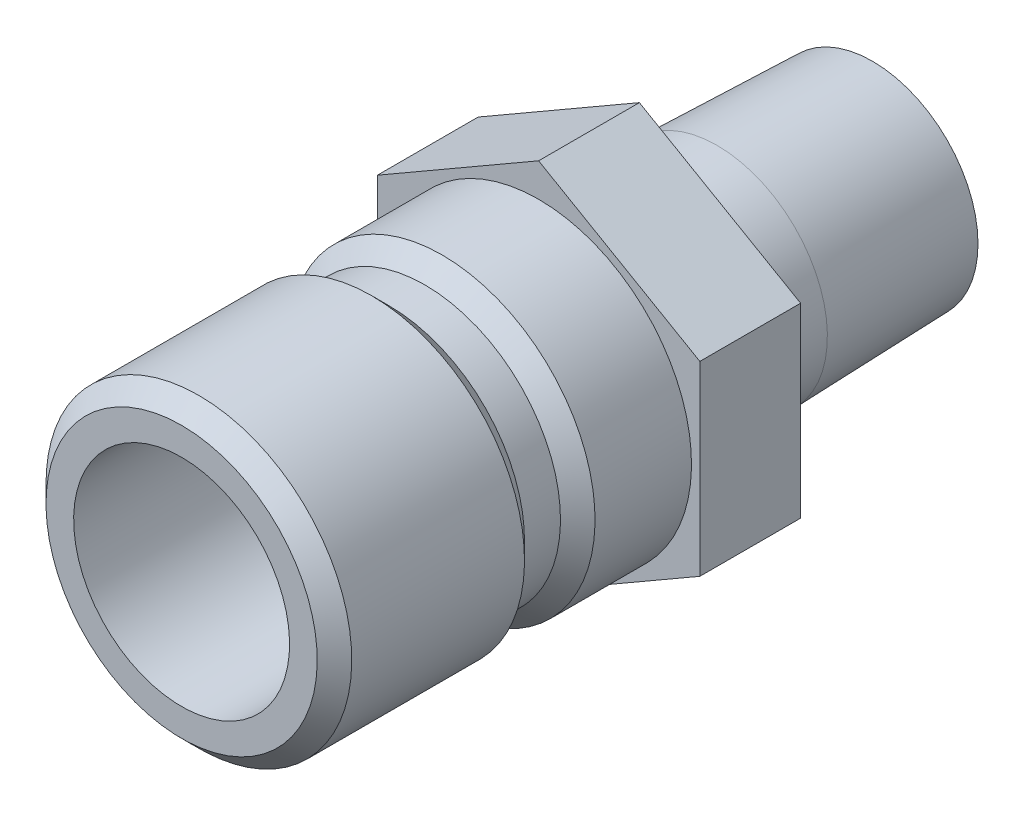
ISO-10303-21;
HEADER;
FILE_DESCRIPTION(('STEP AP214'),'2;1');
FILE_NAME('part.step','',(''),(''),'','','');
FILE_SCHEMA(('AUTOMOTIVE_DESIGN { 1 0 10303 214 1 1 1 1 }'));
ENDSEC;
DATA;
#1=APPLICATION_CONTEXT('core data for automotive mechanical design processes');
#2=APPLICATION_PROTOCOL_DEFINITION('international standard','automotive_design',2000,#1);
#3=PRODUCT_CONTEXT('',#1,'mechanical');
#4=PRODUCT('Part','Part','',(#3));
#5=PRODUCT_RELATED_PRODUCT_CATEGORY('part','',(#4));
#6=PRODUCT_DEFINITION_FORMATION('','',#4);
#7=PRODUCT_DEFINITION_CONTEXT('part definition',#1,'design');
#8=PRODUCT_DEFINITION('design','',#6,#7);
#9=PRODUCT_DEFINITION_SHAPE('','',#8);
#10=(LENGTH_UNIT() NAMED_UNIT(*) SI_UNIT(.MILLI.,.METRE.));
#11=(NAMED_UNIT(*) PLANE_ANGLE_UNIT() SI_UNIT($,.RADIAN.));
#12=(NAMED_UNIT(*) SI_UNIT($,.STERADIAN.) SOLID_ANGLE_UNIT());
#13=UNCERTAINTY_MEASURE_WITH_UNIT(LENGTH_MEASURE(1.E-05),#10,'distance_accuracy_value','');
#14=(GEOMETRIC_REPRESENTATION_CONTEXT(3) GLOBAL_UNCERTAINTY_ASSIGNED_CONTEXT((#13)) GLOBAL_UNIT_ASSIGNED_CONTEXT((#10,
#11,#12)) REPRESENTATION_CONTEXT('',''));
#15=CARTESIAN_POINT('',(0.,0.,0.));
#16=DIRECTION('',(0.,0.,1.));
#17=DIRECTION('',(1.,0.,0.));
#18=AXIS2_PLACEMENT_3D('',#15,#16,#17);
#19=CARTESIAN_POINT('',(0.,0.,0.));
#20=DIRECTION('',(0.,0.,-1.));
#21=DIRECTION('',(0.,1.,0.));
#22=AXIS2_PLACEMENT_3D('',#19,#20,#21);
#23=CYLINDRICAL_SURFACE('',#22,4.8641);
#24=CARTESIAN_POINT('',(0.,0.,-7.874));
#25=DIRECTION('',(0.,0.,-1.));
#26=DIRECTION('',(0.,1.,0.));
#27=AXIS2_PLACEMENT_3D('',#24,#25,#26);
#28=CIRCLE('',#27,4.8641);
#29=CARTESIAN_POINT('',(0.,4.8641,-7.874));
#30=VERTEX_POINT('',#29);
#31=EDGE_CURVE('E162',#30,#30,#28,.T.);
#32=ORIENTED_EDGE('',*,*,#31,.F.);
#33=EDGE_LOOP('',(#32));
#34=FACE_BOUND('',#33,.T.);
#35=CARTESIAN_POINT('',(0.,0.,-4.445));
#36=DIRECTION('',(0.,0.,1.));
#37=DIRECTION('',(1.,0.,0.));
#38=AXIS2_PLACEMENT_3D('',#35,#36,#37);
#39=CIRCLE('',#38,4.8641);
#40=CARTESIAN_POINT('',(4.8641,0.,-4.445));
#41=VERTEX_POINT('',#40);
#42=EDGE_CURVE('E142',#41,#41,#39,.F.);
#43=ORIENTED_EDGE('',*,*,#42,.T.);
#44=EDGE_LOOP('',(#43));
#45=FACE_BOUND('',#44,.T.);
#46=ADVANCED_FACE('F37',(#34,#45),#23,.T.);
#47=CARTESIAN_POINT('',(0.,0.,0.));
#48=DIRECTION('',(0.,0.,-1.));
#49=DIRECTION('',(0.,1.,0.));
#50=AXIS2_PLACEMENT_3D('',#47,#48,#49);
#51=CYLINDRICAL_SURFACE('',#50,4.7625);
#52=CARTESIAN_POINT('',(0.,0.,3.556));
#53=DIRECTION('',(0.,0.,-1.));
#54=DIRECTION('',(0.,1.,0.));
#55=AXIS2_PLACEMENT_3D('',#52,#53,#54);
#56=CIRCLE('',#55,4.7625);
#57=CARTESIAN_POINT('',(0.,4.7625,3.556));
#58=VERTEX_POINT('',#57);
#59=EDGE_CURVE('E150',#58,#58,#56,.T.);
#60=ORIENTED_EDGE('',*,*,#59,.T.);
#61=EDGE_LOOP('',(#60));
#62=FACE_BOUND('',#61,.T.);
#63=CARTESIAN_POINT('',(0.,0.,15.748));
#64=DIRECTION('',(0.,0.,-1.));
#65=DIRECTION('',(0.,1.,0.));
#66=AXIS2_PLACEMENT_3D('',#63,#64,#65);
#67=CIRCLE('',#66,4.7625);
#68=CARTESIAN_POINT('',(0.,4.7625,15.748));
#69=VERTEX_POINT('',#68);
#70=EDGE_CURVE('E11',#69,#69,#67,.T.);
#71=ORIENTED_EDGE('',*,*,#70,.F.);
#72=EDGE_LOOP('',(#71));
#73=FACE_BOUND('',#72,.T.);
#74=ADVANCED_FACE('F39',(#62,#73),#51,.F.);
#75=CARTESIAN_POINT('',(0.,4.7625,15.748));
#76=DIRECTION('',(0.,0.,1.));
#77=DIRECTION('',(0.,-1.,0.));
#78=AXIS2_PLACEMENT_3D('',#75,#76,#77);
#79=PLANE('',#78);
#80=ORIENTED_EDGE('',*,*,#70,.T.);
#81=EDGE_LOOP('',(#80));
#82=FACE_BOUND('',#81,.T.);
#83=CARTESIAN_POINT('',(0.,0.,15.748));
#84=DIRECTION('',(0.,0.,-1.));
#85=DIRECTION('',(0.,1.,0.));
#86=AXIS2_PLACEMENT_3D('',#83,#84,#85);
#87=CIRCLE('',#86,5.9817);
#88=CARTESIAN_POINT('',(0.,5.9817,15.748));
#89=VERTEX_POINT('',#88);
#90=EDGE_CURVE('E46',#89,#89,#87,.T.);
#91=ORIENTED_EDGE('',*,*,#90,.F.);
#92=EDGE_LOOP('',(#91));
#93=FACE_BOUND('',#92,.T.);
#94=ADVANCED_FACE('F188',(#82,#93),#79,.T.);
#95=CARTESIAN_POINT('',(0.,0.,14.986));
#96=DIRECTION('',(0.,0.,-1.));
#97=DIRECTION('',(0.,1.,0.));
#98=AXIS2_PLACEMENT_3D('',#95,#96,#97);
#99=CONICAL_SURFACE('',#98,6.7437,0.785398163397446);
#100=ORIENTED_EDGE('',*,*,#90,.T.);
#101=EDGE_LOOP('',(#100));
#102=FACE_BOUND('',#101,.T.);
#103=CARTESIAN_POINT('',(0.,0.,14.986));
#104=DIRECTION('',(0.,0.,-1.));
#105=DIRECTION('',(0.,1.,0.));
#106=AXIS2_PLACEMENT_3D('',#103,#104,#105);
#107=CIRCLE('',#106,6.7437);
#108=CARTESIAN_POINT('',(0.,6.7437,14.986));
#109=VERTEX_POINT('',#108);
#110=EDGE_CURVE('E180',#109,#109,#107,.T.);
#111=ORIENTED_EDGE('',*,*,#110,.F.);
#112=EDGE_LOOP('',(#111));
#113=FACE_BOUND('',#112,.T.);
#114=ADVANCED_FACE('F185',(#102,#113),#99,.T.);
#115=CARTESIAN_POINT('',(0.,0.,0.));
#116=DIRECTION('',(0.,0.,-1.));
#117=DIRECTION('',(0.,1.,0.));
#118=AXIS2_PLACEMENT_3D('',#115,#116,#117);
#119=CYLINDRICAL_SURFACE('',#118,6.7437);
#120=ORIENTED_EDGE('',*,*,#110,.T.);
#121=EDGE_LOOP('',(#120));
#122=FACE_BOUND('',#121,.T.);
#123=CARTESIAN_POINT('',(0.,0.,7.36599999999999));
#124=DIRECTION('',(0.,0.,-1.));
#125=DIRECTION('',(0.,1.,0.));
#126=AXIS2_PLACEMENT_3D('',#123,#124,#125);
#127=CIRCLE('',#126,6.7437);
#128=CARTESIAN_POINT('',(0.,6.7437,7.36599999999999));
#129=VERTEX_POINT('',#128);
#130=EDGE_CURVE('E177',#129,#129,#127,.T.);
#131=ORIENTED_EDGE('',*,*,#130,.F.);
#132=EDGE_LOOP('',(#131));
#133=FACE_BOUND('',#132,.T.);
#134=ADVANCED_FACE('F195',(#122,#133),#119,.T.);
#135=CARTESIAN_POINT('',(0.,0.,6.604));
#136=DIRECTION('',(0.,0.,1.));
#137=DIRECTION('',(0.,-1.,0.));
#138=AXIS2_PLACEMENT_3D('',#135,#136,#137);
#139=CONICAL_SURFACE('',#138,5.9817,0.785398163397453);
#140=ORIENTED_EDGE('',*,*,#130,.T.);
#141=EDGE_LOOP('',(#140));
#142=FACE_BOUND('',#141,.T.);
#143=CARTESIAN_POINT('',(0.,0.,6.604));
#144=DIRECTION('',(0.,0.,-1.));
#145=DIRECTION('',(0.,1.,0.));
#146=AXIS2_PLACEMENT_3D('',#143,#144,#145);
#147=CIRCLE('',#146,5.9817);
#148=CARTESIAN_POINT('',(0.,5.9817,6.604));
#149=VERTEX_POINT('',#148);
#150=EDGE_CURVE('E174',#149,#149,#147,.T.);
#151=ORIENTED_EDGE('',*,*,#150,.F.);
#152=EDGE_LOOP('',(#151));
#153=FACE_BOUND('',#152,.T.);
#154=ADVANCED_FACE('F220',(#142,#153),#139,.T.);
#155=CARTESIAN_POINT('',(0.,0.,0.));
#156=DIRECTION('',(0.,0.,-1.));
#157=DIRECTION('',(0.,1.,0.));
#158=AXIS2_PLACEMENT_3D('',#155,#156,#157);
#159=CYLINDRICAL_SURFACE('',#158,5.9817);
#160=ORIENTED_EDGE('',*,*,#150,.T.);
#161=EDGE_LOOP('',(#160));
#162=FACE_BOUND('',#161,.T.);
#163=CARTESIAN_POINT('',(0.,0.,5.0165));
#164=DIRECTION('',(0.,0.,-1.));
#165=DIRECTION('',(0.,1.,0.));
#166=AXIS2_PLACEMENT_3D('',#163,#164,#165);
#167=CIRCLE('',#166,5.9817);
#168=CARTESIAN_POINT('',(0.,5.9817,5.0165));
#169=VERTEX_POINT('',#168);
#170=EDGE_CURVE('E171',#169,#169,#167,.T.);
#171=ORIENTED_EDGE('',*,*,#170,.F.);
#172=EDGE_LOOP('',(#171));
#173=FACE_BOUND('',#172,.T.);
#174=ADVANCED_FACE('F216',(#162,#173),#159,.T.);
#175=CARTESIAN_POINT('',(0.,0.,4.25449999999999));
#176=DIRECTION('',(0.,0.,-1.));
#177=DIRECTION('',(0.,1.,0.));
#178=AXIS2_PLACEMENT_3D('',#175,#176,#177);
#179=CONICAL_SURFACE('',#178,6.7437,0.785398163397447);
#180=ORIENTED_EDGE('',*,*,#170,.T.);
#181=EDGE_LOOP('',(#180));
#182=FACE_BOUND('',#181,.T.);
#183=CARTESIAN_POINT('',(0.,0.,4.25449999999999));
#184=DIRECTION('',(0.,0.,-1.));
#185=DIRECTION('',(0.,1.,0.));
#186=AXIS2_PLACEMENT_3D('',#183,#184,#185);
#187=CIRCLE('',#186,6.7437);
#188=CARTESIAN_POINT('',(0.,6.7437,4.25449999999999));
#189=VERTEX_POINT('',#188);
#190=EDGE_CURVE('E168',#189,#189,#187,.T.);
#191=ORIENTED_EDGE('',*,*,#190,.F.);
#192=EDGE_LOOP('',(#191));
#193=FACE_BOUND('',#192,.T.);
#194=ADVANCED_FACE('F212',(#182,#193),#179,.T.);
#195=CARTESIAN_POINT('',(0.,0.,0.));
#196=DIRECTION('',(0.,0.,-1.));
#197=DIRECTION('',(0.,1.,0.));
#198=AXIS2_PLACEMENT_3D('',#195,#196,#197);
#199=CYLINDRICAL_SURFACE('',#198,6.7437);
#200=ORIENTED_EDGE('',*,*,#190,.T.);
#201=EDGE_LOOP('',(#200));
#202=FACE_BOUND('',#201,.T.);
#203=CARTESIAN_POINT('',(0.,0.,0.));
#204=DIRECTION('',(0.,0.,-1.));
#205=DIRECTION('',(0.,1.,0.));
#206=AXIS2_PLACEMENT_3D('',#203,#204,#205);
#207=CIRCLE('',#206,6.7437);
#208=CARTESIAN_POINT('',(0.,6.7437,0.));
#209=VERTEX_POINT('',#208);
#210=EDGE_CURVE('E165',#209,#209,#207,.T.);
#211=ORIENTED_EDGE('',*,*,#210,.F.);
#212=EDGE_LOOP('',(#211));
#213=FACE_BOUND('',#212,.T.);
#214=ADVANCED_FACE('F209',(#202,#213),#199,.T.);
#215=CARTESIAN_POINT('',(0.,0.,-14.732));
#216=DIRECTION('',(0.,0.,1.));
#217=DIRECTION('',(0.,-1.,0.));
#218=AXIS2_PLACEMENT_3D('',#215,#216,#217);
#219=CONICAL_SURFACE('',#218,4.6497887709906,0.0312396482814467);
#220=ORIENTED_EDGE('',*,*,#31,.T.);
#221=EDGE_LOOP('',(#220));
#222=FACE_BOUND('',#221,.T.);
#223=CARTESIAN_POINT('',(0.,0.,-14.732));
#224=DIRECTION('',(0.,0.,-1.));
#225=DIRECTION('',(0.,1.,0.));
#226=AXIS2_PLACEMENT_3D('',#223,#224,#225);
#227=CIRCLE('',#226,4.6497887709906);
#228=CARTESIAN_POINT('',(0.,4.6497887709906,-14.732));
#229=VERTEX_POINT('',#228);
#230=EDGE_CURVE('E159',#229,#229,#227,.T.);
#231=ORIENTED_EDGE('',*,*,#230,.F.);
#232=EDGE_LOOP('',(#231));
#233=FACE_BOUND('',#232,.T.);
#234=ADVANCED_FACE('F207',(#222,#233),#219,.T.);
#235=CARTESIAN_POINT('',(0.,4.6497887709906,-14.732));
#236=DIRECTION('',(0.,0.,-1.));
#237=DIRECTION('',(0.,1.,0.));
#238=AXIS2_PLACEMENT_3D('',#235,#236,#237);
#239=PLANE('',#238);
#240=ORIENTED_EDGE('',*,*,#230,.T.);
#241=EDGE_LOOP('',(#240));
#242=FACE_BOUND('',#241,.T.);
#243=CARTESIAN_POINT('',(0.,0.,-14.732));
#244=DIRECTION('',(0.,0.,-1.));
#245=DIRECTION('',(0.,1.,0.));
#246=AXIS2_PLACEMENT_3D('',#243,#244,#245);
#247=CIRCLE('',#246,3.4163);
#248=CARTESIAN_POINT('',(0.,3.4163,-14.732));
#249=VERTEX_POINT('',#248);
#250=EDGE_CURVE('E156',#249,#249,#247,.T.);
#251=ORIENTED_EDGE('',*,*,#250,.F.);
#252=EDGE_LOOP('',(#251));
#253=FACE_BOUND('',#252,.T.);
#254=ADVANCED_FACE('F273',(#242,#253),#239,.T.);
#255=CARTESIAN_POINT('',(0.,0.,0.));
#256=DIRECTION('',(0.,0.,-1.));
#257=DIRECTION('',(0.,1.,0.));
#258=AXIS2_PLACEMENT_3D('',#255,#256,#257);
#259=CYLINDRICAL_SURFACE('',#258,3.4163);
#260=CARTESIAN_POINT('',(0.,0.,2.84021276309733));
#261=DIRECTION('',(0.,0.,-1.));
#262=DIRECTION('',(0.,1.,0.));
#263=AXIS2_PLACEMENT_3D('',#260,#261,#262);
#264=CIRCLE('',#263,3.4163);
#265=CARTESIAN_POINT('',(0.,3.4163,2.84021276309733));
#266=VERTEX_POINT('',#265);
#267=EDGE_CURVE('E153',#266,#266,#264,.T.);
#268=ORIENTED_EDGE('',*,*,#267,.F.);
#269=EDGE_LOOP('',(#268));
#270=FACE_BOUND('',#269,.T.);
#271=ORIENTED_EDGE('',*,*,#250,.T.);
#272=EDGE_LOOP('',(#271));
#273=FACE_BOUND('',#272,.T.);
#274=ADVANCED_FACE('F270',(#270,#273),#259,.F.);
#275=CARTESIAN_POINT('',(0.,0.,3.556));
#276=DIRECTION('',(0.,0.,1.));
#277=DIRECTION('',(0.,-1.,0.));
#278=AXIS2_PLACEMENT_3D('',#275,#276,#277);
#279=CONICAL_SURFACE('',#278,4.7625,1.08210413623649);
#280=ORIENTED_EDGE('',*,*,#267,.T.);
#281=EDGE_LOOP('',(#280));
#282=FACE_BOUND('',#281,.T.);
#283=ORIENTED_EDGE('',*,*,#59,.F.);
#284=EDGE_LOOP('',(#283));
#285=FACE_BOUND('',#284,.T.);
#286=ADVANCED_FACE('F258',(#282,#285),#279,.F.);
#287=CARTESIAN_POINT('',(0.,8.21223022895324,-4.445));
#288=DIRECTION('',(-0.5,0.866025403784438,0.));
#289=DIRECTION('',(-0.866025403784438,-0.5,0.));
#290=AXIS2_PLACEMENT_3D('',#287,#288,#289);
#291=PLANE('',#290);
#292=DIRECTION('',(-0.866025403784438,-0.5,0.));
#293=VECTOR('',#292,1.);
#294=CARTESIAN_POINT('',(0.,8.21223022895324,0.));
#295=LINE('',#294,#293);
#296=CARTESIAN_POINT('',(0.,8.21223022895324,0.));
#297=VERTEX_POINT('',#296);
#298=CARTESIAN_POINT('',(-7.112,4.10611511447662,0.));
#299=VERTEX_POINT('',#298);
#300=EDGE_CURVE('E125',#297,#299,#295,.T.);
#301=ORIENTED_EDGE('',*,*,#300,.F.);
#302=DIRECTION('',(0.,0.,1.));
#303=VECTOR('',#302,1.);
#304=CARTESIAN_POINT('',(0.,8.21223022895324,-4.445));
#305=LINE('',#304,#303);
#306=CARTESIAN_POINT('',(0.,8.21223022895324,-4.445));
#307=VERTEX_POINT('',#306);
#308=EDGE_CURVE('E54',#307,#297,#305,.T.);
#309=ORIENTED_EDGE('',*,*,#308,.F.);
#310=DIRECTION('',(-0.866025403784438,-0.5,0.));
#311=VECTOR('',#310,1.);
#312=CARTESIAN_POINT('',(0.,8.21223022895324,-4.445));
#313=LINE('',#312,#311);
#314=CARTESIAN_POINT('',(-7.112,4.10611511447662,-4.445));
#315=VERTEX_POINT('',#314);
#316=EDGE_CURVE('E140',#307,#315,#313,.T.);
#317=ORIENTED_EDGE('',*,*,#316,.T.);
#318=DIRECTION('',(0.,0.,1.));
#319=VECTOR('',#318,1.);
#320=CARTESIAN_POINT('',(-7.112,4.10611511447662,-4.445));
#321=LINE('',#320,#319);
#322=EDGE_CURVE('E89',#315,#299,#321,.T.);
#323=ORIENTED_EDGE('',*,*,#322,.T.);
#324=EDGE_LOOP('',(#301,#309,#317,#323));
#325=FACE_BOUND('',#324,.T.);
#326=ADVANCED_FACE('F245',(#325),#291,.T.);
#327=CARTESIAN_POINT('',(7.112,4.10611511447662,-4.445));
#328=DIRECTION('',(0.5,0.866025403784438,0.));
#329=DIRECTION('',(-0.866025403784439,0.5,0.));
#330=AXIS2_PLACEMENT_3D('',#327,#328,#329);
#331=PLANE('',#330);
#332=DIRECTION('',(-0.866025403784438,0.5,0.));
#333=VECTOR('',#332,1.);
#334=CARTESIAN_POINT('',(7.112,4.10611511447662,0.));
#335=LINE('',#334,#333);
#336=CARTESIAN_POINT('',(7.112,4.10611511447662,0.));
#337=VERTEX_POINT('',#336);
#338=EDGE_CURVE('E137',#337,#297,#335,.T.);
#339=ORIENTED_EDGE('',*,*,#338,.F.);
#340=DIRECTION('',(0.,0.,1.));
#341=VECTOR('',#340,1.);
#342=CARTESIAN_POINT('',(7.112,4.10611511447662,-4.445));
#343=LINE('',#342,#341);
#344=CARTESIAN_POINT('',(7.112,4.10611511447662,-4.445));
#345=VERTEX_POINT('',#344);
#346=EDGE_CURVE('E77',#345,#337,#343,.T.);
#347=ORIENTED_EDGE('',*,*,#346,.F.);
#348=DIRECTION('',(-0.866025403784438,0.5,0.));
#349=VECTOR('',#348,1.);
#350=CARTESIAN_POINT('',(7.112,4.10611511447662,-4.445));
#351=LINE('',#350,#349);
#352=EDGE_CURVE('E115',#345,#307,#351,.T.);
#353=ORIENTED_EDGE('',*,*,#352,.T.);
#354=ORIENTED_EDGE('',*,*,#308,.T.);
#355=EDGE_LOOP('',(#339,#347,#353,#354));
#356=FACE_BOUND('',#355,.T.);
#357=ADVANCED_FACE('F250',(#356),#331,.T.);
#358=CARTESIAN_POINT('',(7.112,-4.10611511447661,-4.445));
#359=DIRECTION('',(1.,0.,0.));
#360=DIRECTION('',(0.,1.,0.));
#361=AXIS2_PLACEMENT_3D('',#358,#359,#360);
#362=PLANE('',#361);
#363=DIRECTION('',(0.,1.,0.));
#364=VECTOR('',#363,1.);
#365=CARTESIAN_POINT('',(7.112,-4.10611511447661,0.));
#366=LINE('',#365,#364);
#367=CARTESIAN_POINT('',(7.112,-4.10611511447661,0.));
#368=VERTEX_POINT('',#367);
#369=EDGE_CURVE('E102',#368,#337,#366,.T.);
#370=ORIENTED_EDGE('',*,*,#369,.F.);
#371=DIRECTION('',(0.,0.,1.));
#372=VECTOR('',#371,1.);
#373=CARTESIAN_POINT('',(7.112,-4.10611511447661,-4.445));
#374=LINE('',#373,#372);
#375=CARTESIAN_POINT('',(7.112,-4.10611511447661,-4.445));
#376=VERTEX_POINT('',#375);
#377=EDGE_CURVE('E97',#376,#368,#374,.T.);
#378=ORIENTED_EDGE('',*,*,#377,.F.);
#379=DIRECTION('',(0.,1.,0.));
#380=VECTOR('',#379,1.);
#381=CARTESIAN_POINT('',(7.112,-4.10611511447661,-4.445));
#382=LINE('',#381,#380);
#383=EDGE_CURVE('E100',#376,#345,#382,.T.);
#384=ORIENTED_EDGE('',*,*,#383,.T.);
#385=ORIENTED_EDGE('',*,*,#346,.T.);
#386=EDGE_LOOP('',(#370,#378,#384,#385));
#387=FACE_BOUND('',#386,.T.);
#388=ADVANCED_FACE('F99',(#387),#362,.T.);
#389=CARTESIAN_POINT('',(0.,-8.21223022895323,-4.445));
#390=DIRECTION('',(0.5,-0.866025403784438,0.));
#391=DIRECTION('',(0.866025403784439,0.5,0.));
#392=AXIS2_PLACEMENT_3D('',#389,#390,#391);
#393=PLANE('',#392);
#394=DIRECTION('',(0.866025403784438,0.5,0.));
#395=VECTOR('',#394,1.);
#396=CARTESIAN_POINT('',(0.,-8.21223022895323,0.));
#397=LINE('',#396,#395);
#398=CARTESIAN_POINT('',(0.,-8.21223022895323,0.));
#399=VERTEX_POINT('',#398);
#400=EDGE_CURVE('E134',#399,#368,#397,.T.);
#401=ORIENTED_EDGE('',*,*,#400,.F.);
#402=DIRECTION('',(0.,0.,1.));
#403=VECTOR('',#402,1.);
#404=CARTESIAN_POINT('',(0.,-8.21223022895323,-4.445));
#405=LINE('',#404,#403);
#406=CARTESIAN_POINT('',(0.,-8.21223022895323,-4.445));
#407=VERTEX_POINT('',#406);
#408=EDGE_CURVE('E107',#407,#399,#405,.T.);
#409=ORIENTED_EDGE('',*,*,#408,.F.);
#410=DIRECTION('',(0.866025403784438,0.5,0.));
#411=VECTOR('',#410,1.);
#412=CARTESIAN_POINT('',(0.,-8.21223022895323,-4.445));
#413=LINE('',#412,#411);
#414=EDGE_CURVE('E113',#407,#376,#413,.T.);
#415=ORIENTED_EDGE('',*,*,#414,.T.);
#416=ORIENTED_EDGE('',*,*,#377,.T.);
#417=EDGE_LOOP('',(#401,#409,#415,#416));
#418=FACE_BOUND('',#417,.T.);
#419=ADVANCED_FACE('F117',(#418),#393,.T.);
#420=CARTESIAN_POINT('',(-7.112,-4.10611511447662,-4.445));
#421=DIRECTION('',(-0.5,-0.866025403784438,0.));
#422=DIRECTION('',(0.866025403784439,-0.5,0.));
#423=AXIS2_PLACEMENT_3D('',#420,#421,#422);
#424=PLANE('',#423);
#425=DIRECTION('',(0.866025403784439,-0.5,0.));
#426=VECTOR('',#425,1.);
#427=CARTESIAN_POINT('',(-7.112,-4.10611511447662,0.));
#428=LINE('',#427,#426);
#429=CARTESIAN_POINT('',(-7.112,-4.10611511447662,0.));
#430=VERTEX_POINT('',#429);
#431=EDGE_CURVE('E131',#430,#399,#428,.T.);
#432=ORIENTED_EDGE('',*,*,#431,.F.);
#433=DIRECTION('',(0.,0.,1.));
#434=VECTOR('',#433,1.);
#435=CARTESIAN_POINT('',(-7.112,-4.10611511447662,-4.445));
#436=LINE('',#435,#434);
#437=CARTESIAN_POINT('',(-7.112,-4.10611511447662,-4.445));
#438=VERTEX_POINT('',#437);
#439=EDGE_CURVE('E145',#438,#430,#436,.T.);
#440=ORIENTED_EDGE('',*,*,#439,.F.);
#441=DIRECTION('',(0.866025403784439,-0.5,0.));
#442=VECTOR('',#441,1.);
#443=CARTESIAN_POINT('',(-7.112,-4.10611511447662,-4.445));
#444=LINE('',#443,#442);
#445=EDGE_CURVE('E118',#438,#407,#444,.T.);
#446=ORIENTED_EDGE('',*,*,#445,.T.);
#447=ORIENTED_EDGE('',*,*,#408,.T.);
#448=EDGE_LOOP('',(#432,#440,#446,#447));
#449=FACE_BOUND('',#448,.T.);
#450=ADVANCED_FACE('F249',(#449),#424,.T.);
#451=CARTESIAN_POINT('',(-7.112,4.10611511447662,-4.445));
#452=DIRECTION('',(-1.,0.,0.));
#453=DIRECTION('',(0.,-1.,0.));
#454=AXIS2_PLACEMENT_3D('',#451,#452,#453);
#455=PLANE('',#454);
#456=DIRECTION('',(0.,-1.,0.));
#457=VECTOR('',#456,1.);
#458=CARTESIAN_POINT('',(-7.112,4.10611511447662,0.));
#459=LINE('',#458,#457);
#460=EDGE_CURVE('E128',#299,#430,#459,.T.);
#461=ORIENTED_EDGE('',*,*,#460,.F.);
#462=ORIENTED_EDGE('',*,*,#322,.F.);
#463=DIRECTION('',(0.,-1.,0.));
#464=VECTOR('',#463,1.);
#465=CARTESIAN_POINT('',(-7.112,4.10611511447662,-4.445));
#466=LINE('',#465,#464);
#467=EDGE_CURVE('E120',#315,#438,#466,.T.);
#468=ORIENTED_EDGE('',*,*,#467,.T.);
#469=ORIENTED_EDGE('',*,*,#439,.T.);
#470=EDGE_LOOP('',(#461,#462,#468,#469));
#471=FACE_BOUND('',#470,.T.);
#472=ADVANCED_FACE('F246',(#471),#455,.T.);
#473=CARTESIAN_POINT('',(-7.112,4.10611511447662,-4.445));
#474=DIRECTION('',(0.,0.,1.));
#475=DIRECTION('',(1.,0.,0.));
#476=AXIS2_PLACEMENT_3D('',#473,#474,#475);
#477=PLANE('',#476);
#478=ORIENTED_EDGE('',*,*,#42,.F.);
#479=EDGE_LOOP('',(#478));
#480=FACE_BOUND('',#479,.T.);
#481=ORIENTED_EDGE('',*,*,#316,.F.);
#482=ORIENTED_EDGE('',*,*,#352,.F.);
#483=ORIENTED_EDGE('',*,*,#383,.F.);
#484=ORIENTED_EDGE('',*,*,#414,.F.);
#485=ORIENTED_EDGE('',*,*,#445,.F.);
#486=ORIENTED_EDGE('',*,*,#467,.F.);
#487=EDGE_LOOP('',(#481,#482,#483,#484,#485,#486));
#488=FACE_BOUND('',#487,.T.);
#489=ADVANCED_FACE('F111',(#480,#488),#477,.F.);
#490=CARTESIAN_POINT('',(-7.112,4.10611511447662,0.));
#491=DIRECTION('',(0.,0.,1.));
#492=DIRECTION('',(1.,0.,0.));
#493=AXIS2_PLACEMENT_3D('',#490,#491,#492);
#494=PLANE('',#493);
#495=ORIENTED_EDGE('',*,*,#210,.T.);
#496=EDGE_LOOP('',(#495));
#497=FACE_BOUND('',#496,.T.);
#498=ORIENTED_EDGE('',*,*,#300,.T.);
#499=ORIENTED_EDGE('',*,*,#460,.T.);
#500=ORIENTED_EDGE('',*,*,#431,.T.);
#501=ORIENTED_EDGE('',*,*,#400,.T.);
#502=ORIENTED_EDGE('',*,*,#369,.T.);
#503=ORIENTED_EDGE('',*,*,#338,.T.);
#504=EDGE_LOOP('',(#498,#499,#500,#501,#502,#503));
#505=FACE_BOUND('',#504,.T.);
#506=ADVANCED_FACE('F241',(#497,#505),#494,.T.);
#507=CLOSED_SHELL('',(#46,#74,#94,#114,#134,#154,#174,#194,#214,#234,#254,#274,#286,#326,#357,
#388,#419,#450,#472,#489,#506));
#508=MANIFOLD_SOLID_BREP('B2',#507);
#509=ADVANCED_BREP_SHAPE_REPRESENTATION('',(#18,#508),#14);
#510=SHAPE_DEFINITION_REPRESENTATION(#9,#509);
ENDSEC;
END-ISO-10303-21;
